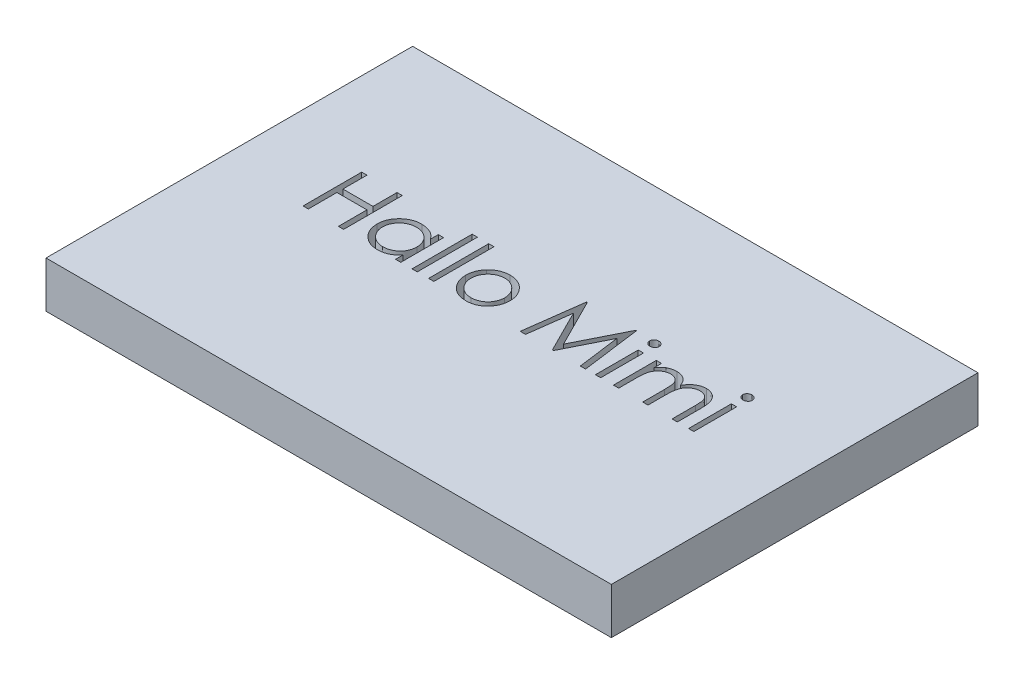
from build123d import *

# Parameters (mm, degrees)
SKIZZE1_W                       = 122.503476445
SKIZZE1_H                       = 79.440456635
AUFSATZ_LINEAR_AUSTRAGEN1_DEPTH = 10
SKIZZE2_W                       = 1.13974359
SKIZZE2_H                       = 13.025641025
SKIZZE2_H_2                     = 9.28076923
SCHNITT_LINEAR_AUSTRAGEN1_DEPTH = 10


with BuildPart() as part:
    # Skizze1 → Aufsatz-Linear austragen1 (new body)
    with BuildSketch(Plane(origin=(0, 0, 0), x_dir=(1, 0, 0), z_dir=(0, 1, 0))):
        with Locations((61.251738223, 39.720228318)):
            Rectangle(SKIZZE1_W, SKIZZE1_H)
    extrude(amount=AUFSATZ_LINEAR_AUSTRAGEN1_DEPTH)

    # Skizze2 → Schnitt-Linear austragen1 (cut)
    # profile 1 of 11: a face of its own
    with BuildSketch(Plane(origin=(0, 10, 0), x_dir=(1, 0, 0), z_dir=(0, 1, 0))):
        Polygon((18.088210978, 50.318010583), (19.227954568, 50.318010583), (19.227954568, 45.107754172), (25.740775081, 45.107754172), (25.740775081, 50.318010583), (26.88051867, 50.318010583), (26.88051867, 37.618010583), (25.740775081, 37.618010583), (25.740775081, 43.80519007), (19.227954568, 43.80519007), (19.227954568, 37.618010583), (18.088210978, 37.618010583), align=None)
    # profile 2 of 11: a face of its own
    with BuildSketch(Plane(origin=(0, 10, 0), x_dir=(1, 0, 0), z_dir=(0, 1, 0))):
        with BuildLine():
            Line((39.254877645, 46.898779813), (39.254877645, 37.618010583))
            Line((39.254877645, 37.618010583), (38.115134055, 37.618010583))
            Line((38.115134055, 37.618010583), (38.115134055, 39.223319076))
            add(Edge.make_bspline(
                [(38.115134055, 39.223319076), (37.986614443, 39.078032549), (37.735806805, 38.794504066), (37.316920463, 38.424091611), (36.872898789, 38.117918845), (36.405896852, 37.870632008), (35.916336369, 37.684877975), (35.405302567, 37.552848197), (34.872586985, 37.467961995), (34.508814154, 37.459485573), (34.324468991, 37.45519007)],
                knots=[0, 0, 0, 0, 1.074387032, 2.096679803, 3.090159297, 4.057316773, 5.018401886, 5.985159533, 6.978961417, 8, 8, 8, 8], degree=3))
            add(Edge.make_bspline(
                [(34.324468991, 37.45519007), (34.160573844, 37.459640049), (33.837365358, 37.468415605), (33.361916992, 37.536495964), (32.904382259, 37.645827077), (32.464328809, 37.797867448), (32.044604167, 37.999546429), (31.641614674, 38.2409961), (31.257448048, 38.528527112), (30.897959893, 38.857232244), (30.566918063, 39.214265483), (30.276410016, 39.595067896), (30.034191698, 39.997992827), (29.831644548, 40.417938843), (29.675629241, 40.858138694), (29.566867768, 41.317070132), (29.498866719, 41.79419053), (29.49009479, 42.119091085), (29.485646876, 42.283835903)],
                knots=[0, 0, 0, 0, 1.033919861, 2.038935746, 3.024066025, 3.998881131, 4.97069526, 5.957263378, 6.95902576, 7.993208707, 9.027059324, 10.027763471, 11.009749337, 11.988697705, 12.965288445, 13.950418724, 14.960734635, 16, 16, 16, 16], degree=3))
            add(Edge.make_bspline(
                [(29.485646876, 42.283835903), (29.490193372, 42.445175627), (29.499181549, 42.764135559), (29.566140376, 43.233232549), (29.678738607, 43.685055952), (29.836755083, 44.118151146), (30.039381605, 44.533042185), (30.285863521, 44.930022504), (30.576218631, 45.310185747), (30.910963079, 45.66459277), (31.273583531, 45.991964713), (31.661509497, 46.276477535), (32.065091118, 46.522192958), (32.490588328, 46.716878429), (32.931703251, 46.874391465), (33.392362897, 46.983368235), (33.870650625, 47.04758423), (34.195373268, 47.056883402), (34.360085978, 47.061600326)],
                knots=[0, 0, 0, 0, 1.020392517, 2.01726096, 2.990465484, 3.961182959, 4.928053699, 5.906110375, 6.912531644, 7.948652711, 8.985773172, 9.998621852, 10.987621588, 11.969261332, 12.953316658, 13.946091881, 14.958173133, 16, 16, 16, 16], degree=3))
            add(Edge.make_bspline(
                [(34.360085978, 47.061600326), (34.549496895, 47.056383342), (34.920922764, 47.046153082), (35.464221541, 46.9610169), (35.978188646, 46.817185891), (36.466791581, 46.621542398), (36.928275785, 46.361559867), (37.358272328, 46.033609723), (37.761281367, 45.639760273), (37.994889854, 45.33724466), (38.115134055, 45.181532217)],
                knots=[0, 0, 0, 0, 1.038897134, 2.037228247, 3.008116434, 3.962042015, 4.918381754, 5.904844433, 6.921570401, 8, 8, 8, 8], degree=3))
            Line((38.115134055, 45.181532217), (38.115134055, 46.898779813))
            Line((38.115134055, 46.898779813), (39.254877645, 46.898779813))
        make_face()
        with BuildLine():
            add(Edge.make_bspline(
                [(34.375350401, 45.921856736), (34.208746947, 45.915928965), (33.879898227, 45.904228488), (33.397138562, 45.812884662), (32.935172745, 45.66090342), (32.496311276, 45.45305195), (32.087486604, 45.191690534), (31.722112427, 44.875564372), (31.397200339, 44.513298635), (31.123938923, 44.10652812), (30.90117912, 43.670453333), (30.744544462, 43.214616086), (30.641241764, 42.747238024), (30.630687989, 42.430236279), (30.625390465, 42.27111555)],
                knots=[0, 0, 0, 0, 1.031046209, 2.035121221, 3.029706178, 4.034933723, 5.034054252, 6.02443088, 7.017295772, 8.038157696, 9.050218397, 10.03989886, 11.016116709, 12, 12, 12, 12], degree=3))
            add(Edge.make_bspline(
                [(30.625390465, 42.27111555), (30.632157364, 42.112945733), (30.645664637, 41.79722607), (30.742731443, 41.329210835), (30.905581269, 40.873266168), (31.127802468, 40.433261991), (31.406065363, 40.024742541), (31.728604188, 39.655571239), (32.098538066, 39.338109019), (32.508303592, 39.072361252), (32.945938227, 38.857685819), (33.406164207, 38.708313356), (33.880330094, 38.61187398), (34.202737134, 38.600609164), (34.365174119, 38.594933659)],
                knots=[0, 0, 0, 0, 0.979072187, 1.954306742, 2.945804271, 3.96968567, 4.997920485, 5.998718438, 6.996577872, 8.005894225, 9.015743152, 10.005417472, 10.995077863, 12, 12, 12, 12], degree=3))
            add(Edge.make_bspline(
                [(34.365174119, 38.594933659), (34.530080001, 38.600956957), (34.858061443, 38.612936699), (35.342253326, 38.704671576), (35.812135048, 38.856232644), (36.261305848, 39.066323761), (36.679738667, 39.326700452), (37.055288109, 39.631526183), (37.372846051, 39.986049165), (37.642059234, 40.375672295), (37.853152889, 40.802798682), (38.006917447, 41.257582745), (38.097827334, 41.740040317), (38.109285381, 42.069746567), (38.115134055, 42.238042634)],
                knots=[0, 0, 0, 0, 1.01762866, 2.023962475, 3.030623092, 4.058876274, 5.077231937, 6.066672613, 7.034107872, 8.005628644, 8.981990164, 9.965428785, 10.961468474, 12, 12, 12, 12], degree=3))
            add(Edge.make_bspline(
                [(38.115134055, 42.238042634), (38.111651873, 42.366268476), (38.104797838, 42.618657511), (38.052435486, 42.989234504), (37.969141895, 43.343868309), (37.851771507, 43.682931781), (37.697588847, 44.004550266), (37.511632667, 44.311033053), (37.290632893, 44.600786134), (37.03814711, 44.869819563), (36.761776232, 45.115207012), (36.469333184, 45.334242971), (36.15735316, 45.514179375), (35.831082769, 45.66310056), (35.489955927, 45.781606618), (35.13119682, 45.860664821), (34.758618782, 45.914949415), (34.504451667, 45.919530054), (34.375350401, 45.921856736)],
                knots=[0, 0, 0, 0, 1.050140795, 2.067009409, 3.05949893, 4.030605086, 5.00011959, 5.97591094, 6.962425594, 7.979863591, 8.993523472, 9.986985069, 10.967611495, 11.937549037, 12.921786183, 13.919465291, 14.943216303, 16, 16, 16, 16], degree=3))
        make_face(mode=Mode.SUBTRACT)
    # profile 3 of 11: a face of its own
    with BuildSketch(Plane(origin=(0, 10, 0), x_dir=(1, 0, 0), z_dir=(0, 1, 0))):
        with Locations((42.267057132, 44.130831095)):
            Rectangle(SKIZZE2_W, SKIZZE2_H)
    # profile 4 of 11: a face of its own
    with BuildSketch(Plane(origin=(0, 10, 0), x_dir=(1, 0, 0), z_dir=(0, 1, 0))):
        with Locations((45.849108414, 44.130831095)):
            Rectangle(SKIZZE2_W, SKIZZE2_H)
    # profile 5 of 11: a face of its own
    with BuildSketch(Plane(origin=(0, 10, 0), x_dir=(1, 0, 0), z_dir=(0, 1, 0))):
        with BuildLine():
            add(Edge.make_bspline(
                [(53.506760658, 47.061600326), (53.680900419, 47.057892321), (54.022345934, 47.05062183), (54.522391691, 46.972916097), (54.999712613, 46.854089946), (55.456136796, 46.68981885), (55.885818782, 46.469630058), (56.295017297, 46.206887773), (56.682610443, 45.895619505), (56.914922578, 45.654834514), (57.032842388, 45.532613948)],
                knots=[0, 0, 0, 0, 1.054011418, 2.066658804, 3.057071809, 4.030435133, 4.997543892, 5.974964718, 6.972108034, 8, 8, 8, 8], degree=3))
            add(Edge.make_bspline(
                [(57.032842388, 45.532613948), (57.134376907, 45.415723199), (57.335480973, 45.184203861), (57.59334801, 44.808807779), (57.815494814, 44.420042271), (57.993523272, 44.012744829), (58.133894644, 43.590471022), (58.233555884, 43.151769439), (58.29283562, 42.697608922), (58.300829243, 42.389166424), (58.304877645, 42.232954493)],
                knots=[0, 0, 0, 0, 1.025258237, 2.030674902, 3.01204498, 3.988269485, 4.97094183, 5.956517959, 6.965070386, 8, 8, 8, 8], degree=3))
            add(Edge.make_bspline(
                [(58.304877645, 42.232954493), (58.301316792, 42.075837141), (58.294280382, 41.765365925), (58.227719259, 41.308095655), (58.124192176, 40.864703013), (57.976030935, 40.437044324), (57.786045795, 40.02381235), (57.554213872, 39.626811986), (57.27890829, 39.245259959), (56.966836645, 38.882396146), (56.621934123, 38.547964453), (56.247769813, 38.256487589), (55.851696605, 38.006763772), (55.428447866, 37.805608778), (54.981888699, 37.647005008), (54.511055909, 37.535607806), (54.01668094, 37.468255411), (53.679125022, 37.459606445), (53.506760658, 37.45519007)],
                knots=[0, 0, 0, 0, 0.998656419, 1.973391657, 2.932242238, 3.890759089, 4.846373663, 5.82037756, 6.809684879, 7.83454468, 8.860553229, 9.859544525, 10.845671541, 11.83227036, 12.833544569, 13.85385346, 14.904124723, 16, 16, 16, 16], degree=3))
            add(Edge.make_bspline(
                [(53.506760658, 37.45519007), (53.333551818, 37.459621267), (52.994313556, 37.468299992), (52.498193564, 37.535346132), (52.026516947, 37.646953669), (51.579373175, 37.80613), (51.154304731, 38.006770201), (50.755936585, 38.255732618), (50.38146832, 38.548050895), (50.036492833, 38.882372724), (49.724440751, 39.245265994), (49.449130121, 39.62681042), (49.217299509, 40.023812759), (49.027314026, 40.437044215), (48.879152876, 40.864703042), (48.775625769, 41.308095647), (48.709064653, 41.765365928), (48.702028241, 42.075837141), (48.698467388, 42.232954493)],
                knots=[0, 0, 0, 0, 1.099876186, 2.154163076, 3.173186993, 4.173200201, 5.163417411, 6.152872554, 7.150605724, 8.17532212, 9.198891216, 10.186952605, 11.159729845, 12.11414092, 13.071450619, 14.029093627, 15.002601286, 16, 16, 16, 16], degree=3))
            add(Edge.make_bspline(
                [(48.698467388, 42.232954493), (48.7025434, 42.388317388), (48.710613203, 42.69590922), (48.769833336, 43.149215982), (48.869105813, 43.58717508), (49.009645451, 44.00781895), (49.189314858, 44.413331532), (49.408340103, 44.803057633), (49.668837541, 45.176756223), (49.869141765, 45.407976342), (49.970502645, 45.524981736)],
                knots=[0, 0, 0, 0, 1.031353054, 2.041901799, 3.029428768, 4.008703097, 4.981709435, 5.96992636, 6.972712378, 8, 8, 8, 8], degree=3))
            add(Edge.make_bspline(
                [(49.970502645, 45.524981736), (50.088244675, 45.64826223), (50.319805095, 45.890715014), (50.709327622, 46.201075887), (51.117519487, 46.46928564), (51.551949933, 46.685099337), (52.007999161, 46.855056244), (52.487766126, 46.973222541), (52.989508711, 47.050341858), (53.33262505, 47.057810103), (53.506760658, 47.061600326)],
                knots=[0, 0, 0, 0, 1.027980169, 2.021703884, 2.998553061, 3.971491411, 4.943284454, 5.930300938, 6.949603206, 8, 8, 8, 8], degree=3))
        make_face()
        with BuildLine():
            add(Edge.make_bspline(
                [(53.501672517, 45.921856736), (53.37852747, 45.918356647), (53.135416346, 45.911446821), (52.777568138, 45.858890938), (52.433071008, 45.775624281), (52.101271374, 45.657318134), (51.783288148, 45.504559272), (51.478816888, 45.316931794), (51.186962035, 45.09692078), (50.913432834, 44.844870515), (50.662399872, 44.569538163), (50.442951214, 44.276174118), (50.256351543, 43.969536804), (50.100902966, 43.649307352), (49.985125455, 43.312240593), (49.901040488, 42.962153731), (49.848534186, 42.598333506), (49.841689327, 42.351006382), (49.838210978, 42.225322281)],
                knots=[0, 0, 0, 0, 1.021534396, 2.016698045, 2.994645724, 3.958388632, 4.93408049, 5.916473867, 6.921342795, 7.962252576, 8.998418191, 10.008913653, 10.997312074, 11.973003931, 12.956656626, 13.948281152, 14.957379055, 16, 16, 16, 16], degree=3))
            add(Edge.make_bspline(
                [(49.838210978, 42.225322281), (49.844041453, 42.062936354), (49.855613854, 41.740630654), (49.949721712, 41.265973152), (50.107151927, 40.810290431), (50.319740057, 40.376253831), (50.586099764, 39.974671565), (50.899924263, 39.616635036), (51.257845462, 39.307532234), (51.655596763, 39.051061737), (52.085053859, 38.847282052), (52.539555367, 38.702868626), (53.013594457, 38.608991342), (53.337555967, 38.599660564), (53.501672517, 38.594933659)],
                knots=[0, 0, 0, 0, 1.016792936, 2.018143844, 3.017858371, 4.030088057, 5.03801393, 6.028138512, 7.003788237, 7.991172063, 8.984598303, 9.972568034, 10.972917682, 12, 12, 12, 12], degree=3))
            add(Edge.make_bspline(
                [(53.501672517, 38.594933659), (53.665779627, 38.599688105), (53.989722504, 38.609073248), (54.463102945, 38.702395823), (54.916362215, 38.84791482), (55.345373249, 39.050832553), (55.742943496, 39.308506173), (56.103438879, 39.614889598), (56.41458384, 39.975619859), (56.680680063, 40.376785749), (56.896749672, 40.809617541), (57.053443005, 41.266057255), (57.147777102, 41.740609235), (57.159318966, 42.062929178), (57.165134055, 42.225322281)],
                knots=[0, 0, 0, 0, 1.02726834, 2.027799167, 3.010890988, 4.004497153, 4.992059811, 5.971914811, 6.958719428, 7.966827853, 8.981595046, 9.981490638, 10.983022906, 12, 12, 12, 12], degree=3))
            add(Edge.make_bspline(
                [(57.165134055, 42.225322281), (57.161656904, 42.351007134), (57.154814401, 42.598335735), (57.102290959, 42.96214521), (57.018269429, 43.31227186), (56.902258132, 43.649191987), (56.747484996, 43.970365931), (56.557286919, 44.275273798), (56.338734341, 44.570554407), (56.084672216, 44.843980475), (55.811428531, 45.097019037), (55.519455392, 45.317017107), (55.215435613, 45.503734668), (54.898376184, 45.658624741), (54.56653401, 45.774547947), (54.22251957, 45.859371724), (53.866198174, 45.911224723), (53.623958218, 45.918290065), (53.501672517, 45.921856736)],
                knots=[0, 0, 0, 0, 1.042956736, 2.052379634, 3.044323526, 4.02829302, 5.004299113, 5.996692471, 7.007513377, 8.048758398, 9.090003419, 10.095195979, 11.07790575, 12.047570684, 13.018257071, 13.989683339, 14.985167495, 16, 16, 16, 16], degree=3))
        make_face(mode=Mode.SUBTRACT)
    # profile 6 of 11: a face of its own
    with BuildSketch(Plane(origin=(0, 10, 0), x_dir=(1, 0, 0), z_dir=(0, 1, 0))):
        Polygon((65.143339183, 37.618010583), (66.819881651, 50.318010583), (66.982702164, 50.318010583), (72.226031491, 39.897497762), (77.456640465, 50.318010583), (77.622005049, 50.318010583), (79.308723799, 37.618010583), (78.163892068, 37.618010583), (76.947826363, 46.756311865), (72.363411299, 37.618010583), (72.106460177, 37.618010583), (67.504236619, 46.776664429), (66.290714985, 37.618010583), align=None)
    # profile 7 of 11: a face of its own
    with BuildSketch(Plane(origin=(0, 10, 0), x_dir=(1, 0, 0), z_dir=(0, 1, 0))):
        with BuildLine():
            add(Edge.make_bspline(
                [(81.990174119, 50.806472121), (82.060899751, 50.803191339), (82.199394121, 50.796766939), (82.399666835, 50.741752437), (82.582027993, 50.648499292), (82.743781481, 50.523387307), (82.882581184, 50.376250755), (82.979756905, 50.204760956), (83.042213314, 50.019491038), (83.0497555, 49.890259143), (83.053595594, 49.824460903)],
                knots=[0, 0, 0, 0, 1.055194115, 2.066272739, 3.074728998, 4.095836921, 5.109056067, 6.073838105, 7.019297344, 8, 8, 8, 8], degree=3))
            add(Edge.make_bspline(
                [(83.053595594, 49.824460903), (83.049668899, 49.760370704), (83.04190629, 49.633671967), (82.979805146, 49.451613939), (82.881753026, 49.282506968), (82.743870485, 49.135656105), (82.582004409, 49.010613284), (82.3996731, 48.917341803), (82.199392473, 48.862332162), (82.060899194, 48.855907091), (81.990174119, 48.852625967)],
                knots=[0, 0, 0, 0, 0.96129708, 1.900370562, 2.859976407, 3.87933698, 4.906634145, 5.921202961, 6.938410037, 8, 8, 8, 8], degree=3))
            add(Edge.make_bspline(
                [(81.990174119, 48.852625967), (81.920257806, 48.855781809), (81.784174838, 48.861924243), (81.586900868, 48.918421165), (81.406094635, 49.010645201), (81.24402568, 49.134837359), (81.108933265, 49.283408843), (81.010605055, 49.451510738), (80.948647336, 49.633698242), (80.940865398, 49.760379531), (80.936928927, 49.824460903)],
                knots=[0, 0, 0, 0, 1.054934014, 2.053291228, 3.073705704, 4.106921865, 5.123545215, 6.088680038, 7.033164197, 8, 8, 8, 8], degree=3))
            add(Edge.make_bspline(
                [(80.936928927, 49.824460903), (80.940779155, 49.890249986), (80.948341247, 50.019463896), (81.010651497, 50.204865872), (81.108114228, 50.375341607), (81.24411513, 50.524205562), (81.406070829, 50.648467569), (81.586907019, 50.74067313), (81.784173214, 50.797174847), (81.920257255, 50.803316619), (81.990174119, 50.806472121)],
                knots=[0, 0, 0, 0, 0.98631895, 1.937192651, 2.907499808, 3.917963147, 4.944918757, 5.95915025, 6.951458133, 8, 8, 8, 8], degree=3))
        make_face()
    # profile 8 of 11: a face of its own
    with BuildSketch(Plane(origin=(0, 10, 0), x_dir=(1, 0, 0), z_dir=(0, 1, 0))):
        with Locations((81.99526226, 42.258395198)):
            Rectangle(SKIZZE2_W, SKIZZE2_H_2)
    # profile 9 of 11: a face of its own
    with BuildSketch(Plane(origin=(0, 10, 0), x_dir=(1, 0, 0), z_dir=(0, 1, 0))):
        with BuildLine():
            Line((85.333082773, 46.898779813), (86.472826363, 46.898779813))
            Line((86.472826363, 46.898779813), (86.472826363, 45.285839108))
            add(Edge.make_bspline(
                [(86.472826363, 45.285839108), (86.575456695, 45.426945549), (86.772106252, 45.697319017), (87.094561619, 46.053609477), (87.416692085, 46.355971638), (87.648678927, 46.514695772), (87.760126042, 46.590947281)],
                knots=[0, 0, 0, 0, 1.134379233, 2.173579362, 3.122582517, 4, 4, 4, 4], degree=3))
            add(Edge.make_bspline(
                [(87.760126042, 46.590947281), (87.912034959, 46.663538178), (88.213198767, 46.807451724), (88.690062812, 46.953442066), (89.178013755, 47.043158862), (89.507517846, 47.055428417), (89.673267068, 47.061600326)],
                knots=[0, 0, 0, 0, 1.014936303, 2.012140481, 3.000054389, 4, 4, 4, 4], degree=3))
            add(Edge.make_bspline(
                [(89.673267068, 47.061600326), (89.785364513, 47.057807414), (90.007199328, 47.050301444), (90.335890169, 47.001460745), (90.654691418, 46.917037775), (90.961719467, 46.799445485), (91.250991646, 46.657036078), (91.516201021, 46.489941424), (91.754323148, 46.302354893), (91.965237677, 46.085805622), (92.154899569, 45.834212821), (92.329357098, 45.540791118), (92.490557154, 45.198951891), (92.579897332, 44.950879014), (92.626932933, 44.820274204)],
                knots=[0, 0, 0, 0, 1.009824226, 1.998387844, 2.986035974, 3.974953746, 4.955485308, 5.885931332, 6.793869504, 7.679848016, 8.601185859, 9.625726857, 10.749998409, 12, 12, 12, 12], degree=3))
            add(Edge.make_bspline(
                [(92.626932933, 44.820274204), (92.676685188, 44.909988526), (92.774590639, 45.086533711), (92.938985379, 45.336390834), (93.111225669, 45.570095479), (93.292779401, 45.787833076), (93.483005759, 45.988528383), (93.682799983, 46.172844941), (93.891024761, 46.341574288), (94.180556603, 46.538689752), (94.557248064, 46.74806261), (95.032184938, 46.929594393), (95.52621556, 47.041775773), (95.86155978, 47.054948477), (96.030899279, 47.061600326)],
                knots=[0, 0, 0, 0, 0.86119277, 1.694706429, 2.50939023, 3.298075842, 4.073795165, 4.829715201, 5.57930267, 6.321991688, 7.768977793, 9.186738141, 10.579381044, 12, 12, 12, 12], degree=3))
            add(Edge.make_bspline(
                [(96.030899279, 47.061600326), (96.18649773, 47.055732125), (96.491019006, 47.044247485), (96.934347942, 46.954064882), (97.347793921, 46.799205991), (97.730525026, 46.587901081), (98.075819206, 46.322365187), (98.375961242, 46.006429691), (98.629127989, 45.642329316), (98.794513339, 45.299821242), (98.906691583, 44.997433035), (98.975856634, 44.739781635), (99.03696067, 44.456203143), (99.087692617, 44.14635848), (99.124771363, 43.809153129), (99.152242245, 43.445138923), (99.170835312, 43.054032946), (99.172149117, 42.784192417), (99.172826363, 42.645093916)],
                knots=[0, 0, 0, 0, 1.209669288, 2.367440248, 3.500751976, 4.631527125, 5.755587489, 6.87532382, 8.007944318, 9.190864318, 9.82315674, 10.514484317, 11.263564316, 12.079023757, 12.955305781, 13.901327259, 14.918167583, 16, 16, 16, 16], degree=3))
            Line((99.172826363, 42.645093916), (99.172826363, 37.618010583))
            Line((99.172826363, 37.618010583), (98.033082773, 37.618010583))
            Line((98.033082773, 37.618010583), (98.033082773, 42.650182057))
            add(Edge.make_bspline(
                [(98.033082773, 42.650182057), (98.032800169, 42.768910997), (98.032257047, 42.997089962), (98.022483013, 43.324577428), (98.004066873, 43.623094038), (97.982532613, 43.892232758), (97.952619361, 44.132621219), (97.913989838, 44.343776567), (97.873067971, 44.527359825), (97.805083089, 44.730872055), (97.696415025, 44.955372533), (97.53088874, 45.197483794), (97.322354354, 45.408234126), (97.081561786, 45.59118059), (96.807428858, 45.739928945), (96.505296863, 45.846159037), (96.17704159, 45.911919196), (95.949810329, 45.918472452), (95.832461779, 45.921856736)],
                knots=[0, 0, 0, 0, 1.253487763, 2.409012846, 3.458416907, 4.410876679, 5.259312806, 6.014470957, 6.676830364, 7.243083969, 8.276244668, 9.299465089, 10.325150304, 11.392391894, 12.482080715, 13.603491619, 14.762376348, 16, 16, 16, 16], degree=3))
            add(Edge.make_bspline(
                [(95.832461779, 45.921856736), (95.688516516, 45.916718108), (95.404025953, 45.906562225), (94.988752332, 45.802879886), (94.589714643, 45.64656012), (94.218819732, 45.420019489), (93.877633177, 45.148571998), (93.584083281, 44.825812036), (93.341577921, 44.460669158), (93.177370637, 44.122679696), (93.073632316, 43.819079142), (93.005136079, 43.553840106), (92.951856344, 43.252372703), (92.901888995, 42.916702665), (92.869276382, 42.544519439), (92.83963686, 42.13754467), (92.825772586, 41.694554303), (92.823833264, 41.387480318), (92.822826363, 41.22804664)],
                knots=[0, 0, 0, 0, 1.090531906, 2.155305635, 3.229839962, 4.33261226, 5.44038871, 6.529323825, 7.629011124, 8.757537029, 9.370236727, 10.061839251, 10.834451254, 11.692844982, 12.636905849, 13.66920014, 14.789842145, 16, 16, 16, 16], degree=3))
            Line((92.822826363, 41.22804664), (92.822826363, 37.618010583))
            Line((92.822826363, 37.618010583), (91.683082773, 37.618010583))
            Line((91.683082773, 37.618010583), (91.683082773, 42.337261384))
            add(Edge.make_bspline(
                [(91.683082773, 42.337261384), (91.682794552, 42.470405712), (91.682240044, 42.726562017), (91.672528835, 43.093895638), (91.654071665, 43.428018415), (91.632733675, 43.728542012), (91.602035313, 43.994920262), (91.567165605, 44.228581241), (91.525986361, 44.428939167), (91.457805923, 44.648697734), (91.353613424, 44.890799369), (91.186016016, 45.148939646), (90.976982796, 45.374883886), (90.731797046, 45.567774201), (90.456004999, 45.727219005), (90.15126523, 45.842098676), (89.82032169, 45.908952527), (89.592165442, 45.917474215), (89.474829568, 45.921856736)],
                knots=[0, 0, 0, 0, 1.320475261, 2.540461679, 3.643808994, 4.639130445, 5.527981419, 6.302341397, 6.981980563, 7.553956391, 8.582137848, 9.585246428, 10.591171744, 11.620968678, 12.668337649, 13.738356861, 14.836885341, 16, 16, 16, 16], degree=3))
            add(Edge.make_bspline(
                [(89.474829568, 45.921856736), (89.336885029, 45.916303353), (89.061966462, 45.905235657), (88.658099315, 45.805615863), (88.268079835, 45.649572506), (87.898129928, 45.433092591), (87.558226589, 45.164944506), (87.260653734, 44.849567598), (87.010490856, 44.49088682), (86.844549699, 44.156461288), (86.737512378, 43.860466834), (86.666409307, 43.608821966), (86.605305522, 43.329421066), (86.5598975, 43.02140212), (86.516062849, 42.686771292), (86.494907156, 42.323861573), (86.474327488, 41.932984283), (86.473339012, 41.66311819), (86.472826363, 41.52315882)],
                knots=[0, 0, 0, 0, 1.098833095, 2.189935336, 3.297829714, 4.440610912, 5.596351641, 6.740013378, 7.886572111, 9.072425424, 9.705826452, 10.395263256, 11.156850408, 11.985370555, 12.878090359, 13.847760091, 14.883794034, 16, 16, 16, 16], degree=3))
            Line((86.472826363, 41.52315882), (86.472826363, 37.618010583))
            Line((86.472826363, 37.618010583), (85.333082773, 37.618010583))
            Line((85.333082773, 37.618010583), (85.333082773, 46.898779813))
        make_face()
    # profile 10 of 11: a face of its own
    with BuildSketch(Plane(origin=(0, 10, 0), x_dir=(1, 0, 0), z_dir=(0, 1, 0))):
        with BuildLine():
            add(Edge.make_bspline(
                [(102.179917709, 50.806472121), (102.250643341, 50.803191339), (102.389137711, 50.796766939), (102.589410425, 50.741752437), (102.771771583, 50.648499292), (102.933525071, 50.523387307), (103.072324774, 50.376250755), (103.169500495, 50.204760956), (103.231956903, 50.019491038), (103.23949909, 49.890259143), (103.243339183, 49.824460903)],
                knots=[0, 0, 0, 0, 1.055194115, 2.066272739, 3.074728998, 4.095836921, 5.109056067, 6.073838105, 7.019297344, 8, 8, 8, 8], degree=3))
            add(Edge.make_bspline(
                [(103.243339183, 49.824460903), (103.239412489, 49.760370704), (103.231649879, 49.633671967), (103.169548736, 49.451613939), (103.071496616, 49.282506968), (102.933614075, 49.135656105), (102.771747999, 49.010613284), (102.58941669, 48.917341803), (102.389136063, 48.862332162), (102.250642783, 48.855907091), (102.179917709, 48.852625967)],
                knots=[0, 0, 0, 0, 0.96129708, 1.900370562, 2.859976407, 3.87933698, 4.906634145, 5.921202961, 6.938410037, 8, 8, 8, 8], degree=3))
            add(Edge.make_bspline(
                [(102.179917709, 48.852625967), (102.110001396, 48.855781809), (101.973918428, 48.861924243), (101.776644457, 48.918421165), (101.595838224, 49.010645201), (101.433769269, 49.134837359), (101.298676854, 49.283408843), (101.200348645, 49.451510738), (101.138390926, 49.633698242), (101.130608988, 49.760379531), (101.126672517, 49.824460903)],
                knots=[0, 0, 0, 0, 1.054934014, 2.053291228, 3.073705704, 4.106921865, 5.123545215, 6.088680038, 7.033164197, 8, 8, 8, 8], degree=3))
            add(Edge.make_bspline(
                [(101.126672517, 49.824460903), (101.130522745, 49.890249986), (101.138084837, 50.019463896), (101.200395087, 50.204865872), (101.297857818, 50.375341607), (101.43385872, 50.524205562), (101.595814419, 50.648467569), (101.776650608, 50.74067313), (101.973916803, 50.797174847), (102.110000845, 50.803316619), (102.179917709, 50.806472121)],
                knots=[0, 0, 0, 0, 0.98631895, 1.937192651, 2.907499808, 3.917963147, 4.944918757, 5.95915025, 6.951458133, 8, 8, 8, 8], degree=3))
        make_face()
    # profile 11 of 11: a face of its own
    with BuildSketch(Plane(origin=(0, 10, 0), x_dir=(1, 0, 0), z_dir=(0, 1, 0))):
        with Locations((102.18500585, 42.258395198)):
            Rectangle(SKIZZE2_W, SKIZZE2_H_2)
    extrude(amount=-SCHNITT_LINEAR_AUSTRAGEN1_DEPTH, mode=Mode.SUBTRACT)


with BuildPart() as schnitt_linear_austragen1_piece_1:
    # of the separate pieces the step leaves, piece 1, a body of its own (schnitt_linear_austragen1_pieces)
    add(part.part.solids().sort_by_distance((0, 0, 0))[0])


with BuildPart() as schnitt_linear_austragen1_piece_2:
    # of the separate pieces the step leaves, piece 2, a body of its own (schnitt_linear_austragen1_pieces)
    add(part.part.solids().sort_by_distance((38.115134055, 0, -42.238042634))[0])


with BuildPart() as schnitt_linear_austragen1_piece_3:
    # of the separate pieces the step leaves, piece 3, a body of its own (schnitt_linear_austragen1_pieces)
    add(part.part.solids().sort_by_distance((57.165134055, 0, -42.225322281))[0])


solid = Compound([schnitt_linear_austragen1_piece_1.part, schnitt_linear_austragen1_piece_2.part, schnitt_linear_austragen1_piece_3.part])
